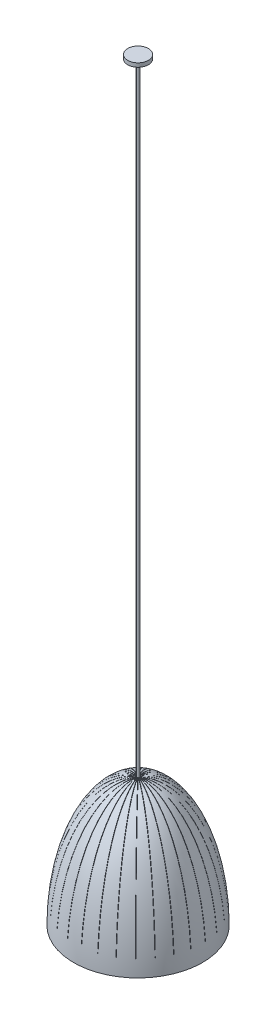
from build123d import *

# Parameters (mm, degrees)
CORTAR_EXTRUIR1_DEPTH = 2451.637672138


with BuildPart() as part:
    # Croquis1 → Revoluci_n1 (revolve)
    with BuildSketch(Plane.XY, mode=Mode.PRIVATE) as revoluci_n1_sk:
        with BuildLine():
            add(Edge.make_bspline(
                [(-4.920047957, 497.901588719), (-8.902642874, 497.742253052), (-16.832240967, 497.039688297), (-32.68000036, 494.094536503), (-52.332014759, 487.535335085), (-75.478385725, 475.108515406), (-105.459649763, 452.596403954), (-140.73165934, 413.650663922), (-177.849518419, 351.325641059), (-208.30906506, 275.76573709), (-227.163266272, 204.143466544), (-237.901740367, 143.276719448), (-243.710636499, 96.27221137), (-247.218067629, 48.374945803), (-248, 16.101194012), (-248, 0)],
                knots=[0.020001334, 0.020001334, 0.020001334, 0.020001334, 0.068463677, 0.116926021, 0.213850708, 0.310775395, 0.407700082, 0.601549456, 0.79539883, 0.989248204, 1.183097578, 1.280022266, 1.376946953, 1.47387164, 1.570796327, 1.570796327, 1.570796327, 1.570796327], degree=3))
            Line((-4.920047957, 497.901588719), (0, 497.901588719))
            Line((0, 497.901588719), (0, 500))
            Line((0, 500), (0, 2925))
            Line((0, 2925), (-40, 2925))
            Line((-40, 2925), (-40, 2910))
            Line((-40, 2910), (-10, 2910))
            Line((-10, 2910), (-10, 2900))
            Line((-10, 2900), (-5, 2900))
            Line((-5, 2900), (-5, 500))
            Line((-5, 500), (-5, 499.899989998))
            add(Edge.make_bspline(
                [(-5, 499.899989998), (-250, 490.09802941), (-250, 0)],
                knots=[0.020001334, 0.020001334, 0.020001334, 1.570796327, 1.570796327, 1.570796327], degree=2, weights=[1, 0.714142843, 1]))
            Line((-250, 0), (-248, 0))
        make_face()
    revolve(revoluci_n1_sk.sketch.rotate(Axis((0, 500, 0), (0, 1, 0)), 270), axis=Axis((0, 500, 0), (0, 1, 0)))

    # Croquis17 → Cortar-Extruir1 (cut, through all)
    with BuildSketch(Plane(origin=(0, 500, 0), x_dir=(-1, 0, 0), z_dir=(0, -1, 0))):
        with BuildLine():
            ThreePointArc((-3.425797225, 3.565925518), (-3.768789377, 3.201271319), (-4.073153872, 2.803806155))
            Line((-4.073153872, 2.803806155), (-189.339085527, 160.17010691))
            ThreePointArc((-189.339085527, 160.17010691), (-189.015793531, 160.551494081), (-188.691733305, 160.932228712))
            Line((-188.691733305, 160.932228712), (-3.425797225, 3.565925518))
        make_face()
        with BuildLine():
            ThreePointArc((-2.579135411, 4.219001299), (-2.992498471, 3.936605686), (-3.375190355, 3.613862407))
            Line((-3.375190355, 3.613862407), (-150.480604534, 197.127725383))
            ThreePointArc((-150.480604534, 197.127725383), (-150.082883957, 197.430697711), (-149.684553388, 197.732867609))
            Line((-149.684553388, 197.732867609), (-2.579135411, 4.219001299))
        make_face()
        with BuildLine():
            ThreePointArc((-1.611876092, 4.674801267), (-2.076281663, 4.487868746), (-2.519406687, 4.254938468))
            Line((-2.519406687, 4.254938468), (-104.58581772, 224.86787051))
            ThreePointArc((-104.58581772, 224.86787051), (-104.132265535, 225.078261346), (-103.678290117, 225.287737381))
            Line((-103.678290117, 225.287737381), (-1.611876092, 4.674801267))
        make_face()
        with BuildLine():
            ThreePointArc((-0.569247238, 4.912012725), (-1.062980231, 4.829284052), (-1.545818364, 4.697058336))
            Line((-1.545818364, 4.697058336), (-53.800714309, 242.093443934))
            ThreePointArc((-53.800714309, 242.093443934), (-53.31253811, 242.201415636), (-52.82414523, 242.308402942))
            Line((-52.82414523, 242.308402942), (-0.569247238, 4.912012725))
        make_face()
        with BuildLine():
            ThreePointArc((0.499998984, 4.919543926), (2.4974e-05, 4.944887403), (-0.499949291, 4.919548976))
            Line((-0.499949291, 4.919548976), (-0.499949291, 247.998996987))
            ThreePointArc((-0.499949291, 247.998996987), (2.4343e-05, 247.999500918), (0.499997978, 247.998996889))
            Line((0.499997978, 247.998996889), (0.499998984, 4.919543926))
        make_face()
        with BuildLine():
            ThreePointArc((1.545865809, 4.697042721), (1.063029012, 4.829273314), (0.569296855, 4.912006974))
            Line((0.569296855, 4.912006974), (52.8241928, 242.308392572))
            ThreePointArc((52.8241928, 242.308392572), (53.312585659, 242.20140517), (53.800761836, 242.093433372))
            Line((53.800761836, 242.093433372), (1.545865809, 4.697042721))
        make_face()
        with BuildLine():
            ThreePointArc((2.519449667, 4.254913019), (2.076326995, 4.487847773), (1.611923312, 4.674784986))
            Line((1.611923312, 4.674784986), (103.678334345, 225.287717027))
            ThreePointArc((103.678334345, 225.287717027), (104.132309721, 225.078240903), (104.585861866, 224.867849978))
            Line((104.585861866, 224.867849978), (2.519449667, 4.254913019))
        make_face()
        with BuildLine():
            ThreePointArc((3.375226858, 3.613828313), (2.992538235, 3.936575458), (2.579178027, 4.218975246))
            Line((2.579178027, 4.218975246), (149.684592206, 197.732838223))
            ThreePointArc((149.684592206, 197.732838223), (150.082922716, 197.430668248), (150.480643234, 197.127695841))
            Line((150.480643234, 197.127695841), (3.375226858, 3.613828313))
        make_face()
        with BuildLine():
            ThreePointArc((4.073182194, 2.803765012), (3.768821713, 3.20123325), (3.425833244, 3.565890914))
            Line((3.425833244, 3.565890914), (188.691764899, 160.932191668))
            ThreePointArc((188.691764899, 160.932191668), (189.01582505, 160.551456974), (189.339116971, 160.170069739))
            Line((189.339116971, 160.170069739), (4.073182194, 2.803765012))
        make_face()
        with BuildLine():
            ThreePointArc((4.580680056, 1.862600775), (4.368879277, 2.316204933), (4.112300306, 2.746069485))
            Line((4.112300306, 2.746069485), (218.87592038, 116.606534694))
            ThreePointArc((218.87592038, 116.606534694), (219.110557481, 116.165038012), (219.344304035, 115.723069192))
            Line((219.344304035, 115.723069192), (4.580680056, 1.862600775))
        make_face()
        with BuildLine():
            ThreePointArc((4.873990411, 0.834343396), (4.764652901, 1.322873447), (4.606480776, 1.7978449))
            Line((4.606480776, 1.7978449), (238.825681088, 66.828485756))
            ThreePointArc((238.825681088, 66.828485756), (238.959923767, 66.346870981), (239.093195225, 65.864986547))
            Line((239.093195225, 65.864986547), (4.873990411, 0.834343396))
        make_face()
        with BuildLine():
            ThreePointArc((4.93939839, -0.232926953), (4.937636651, 0.267685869), (4.885267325, 0.765555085))
            Line((4.885267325, 0.765555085), (247.608218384, 13.9256111))
            ThreePointArc((247.608218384, 13.9256111), (247.635789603, 13.426398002), (247.66235434, 12.927130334))
            Line((247.66235434, 12.927130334), (4.93939839, -0.232926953))
        make_face()
        with BuildLine():
            ThreePointArc((4.773845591, -1.289305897), (4.879741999, -0.800018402), (4.935624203, -0.302531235))
            Line((4.935624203, -0.302531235), (244.812870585, -39.628409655))
            ThreePointArc((244.812870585, -39.628409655), (244.732481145, -40.121878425), (244.651097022, -40.615184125))
            Line((244.651097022, -40.615184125), (4.773845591, -1.289305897))
        make_face()
        with BuildLine():
            ThreePointArc((4.385073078, -2.28539833), (4.593676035, -1.830314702), (4.755196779, -1.356471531))
            Line((4.755196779, -1.356471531), (230.570345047, -91.329450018))
            ThreePointArc((230.570345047, -91.329450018), (230.385753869, -91.794100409), (230.200226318, -92.258377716))
            Line((230.200226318, -92.258377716), (4.385073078, -2.28539833))
        make_face()
        with BuildLine():
            ThreePointArc((3.791259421, -3.174628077), (4.092814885, -2.775027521), (4.352421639, -2.346984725))
            Line((4.352421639, -2.346984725), (205.546606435, -138.760026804))
            ThreePointArc((205.546606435, -138.760026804), (205.266444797, -139.17413228), (204.985448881, -139.587672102))
            Line((204.985448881, -139.587672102), (3.791259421, -3.174628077))
        make_face()
        with BuildLine():
            ThreePointArc((3.020170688, -3.915415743), (3.40057826, -3.589983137), (3.7461321, -3.227755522))
            Line((3.7461321, -3.227755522), (170.911736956, -179.702338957))
            ThreePointArc((170.911736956, -179.702338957), (170.549104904, -180.046536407), (170.185779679, -180.390002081))
            Line((170.185779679, -180.390002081), (3.020170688, -3.915415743))
        make_face()
        with BuildLine():
            ThreePointArc((2.107862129, -4.473122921), (2.549334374, -4.237075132), (2.964677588, -3.957600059))
            Line((2.964677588, -3.957600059), (128.28522461, -212.241969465))
            ThreePointArc((128.28522461, -212.241969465), (127.857078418, -212.500164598), (127.428412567, -212.757496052))
            Line((127.428412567, -212.757496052), (2.107862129, -4.473122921))
        make_face()
        with BuildLine():
            ThreePointArc((1.096992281, -4.821671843), (1.578886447, -4.686046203), (2.044598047, -4.502391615))
            Line((2.044598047, -4.502391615), (79.660237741, -234.857401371))
            ThreePointArc((79.660237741, -234.857401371), (79.186597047, -235.01752127), (78.71263451, -235.176685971))
            Line((78.71263451, -235.176685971), (1.096992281, -4.821671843))
        make_face()
        with BuildLine():
            ThreePointArc((0.034828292, -4.944764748), (0.534611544, -4.915902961), (1.028915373, -4.836656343))
            Line((1.028915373, -4.836656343), (27.310426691, -246.491162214))
            ThreePointArc((27.310426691, -246.491162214), (26.813438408, -246.54571985), (26.316341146, -246.599275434))
            Line((26.316341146, -246.599275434), (0.034828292, -4.944764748))
        make_face()
        with BuildLine():
            ThreePointArc((-1.028964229, -4.83664595), (-0.5346612, -4.915897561), (-0.034878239, -4.944764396))
            Line((-0.034878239, -4.944764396), (-26.316389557, -246.599270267))
            ThreePointArc((-26.316389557, -246.599270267), (-26.81348681, -246.545714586), (-27.310475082, -246.491156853))
            Line((-27.310475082, -246.491156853), (-1.028964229, -4.83664595))
        make_face()
        with BuildLine():
            ThreePointArc((-2.044643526, -4.502370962), (-1.578933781, -4.686030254), (-1.097040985, -4.821660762))
            Line((-1.097040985, -4.821660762), (-78.712680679, -235.176670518))
            ThreePointArc((-78.712680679, -235.176670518), (-79.186643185, -235.017505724), (-79.660283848, -234.857385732))
            Line((-79.660283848, -234.857385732), (-2.044643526, -4.502370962))
        make_face()
        with BuildLine():
            ThreePointArc((-2.964717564, -3.957570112), (-2.549377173, -4.237049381), (-2.107907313, -4.473101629))
            Line((-2.107907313, -4.473101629), (-127.428454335, -212.757471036))
            ThreePointArc((-127.428454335, -212.757471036), (-127.857120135, -212.500139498), (-128.285266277, -212.24194428))
            Line((-128.285266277, -212.24194428), (-2.964717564, -3.957570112))
        make_face()
        with BuildLine():
            ThreePointArc((-3.746164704, -3.227717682), (-3.400614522, -3.589948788), (-3.020210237, -3.915385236))
            Line((-3.020210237, -3.915385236), (-170.185815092, -180.389968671))
            ThreePointArc((-170.185815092, -180.389968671), (-170.549140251, -180.046502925), (-170.911772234, -179.702305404))
            Line((-170.911772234, -179.702305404), (-3.746164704, -3.227717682))
        make_face()
        with BuildLine():
            ThreePointArc((-4.352445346, -2.346940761), (-4.092842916, -2.774986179), (-3.791291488, -3.174589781))
            Line((-3.791291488, -3.174589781), (-204.985476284, -139.58763186))
            ThreePointArc((-204.985476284, -139.58763186), (-205.26647212, -139.174091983), (-205.546633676, -138.759986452))
            Line((-205.546633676, -138.759986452), (-4.352445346, -2.346940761))
        make_face()
        with BuildLine():
            ThreePointArc((-4.755210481, -1.356423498), (-4.593694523, -1.830268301), (-4.385096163, -2.285354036))
            Line((-4.385096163, -2.285354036), (-230.20024443, -92.258332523))
            ThreePointArc((-230.20024443, -92.258332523), (-230.38577189, -91.794055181), (-230.570362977, -91.329404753))
            Line((-230.570362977, -91.329404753), (-4.755210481, -1.356423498))
        make_face()
        with BuildLine():
            ThreePointArc((-4.935627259, -0.30248138), (-4.87975008, -0.799969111), (-4.773858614, -1.289257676))
            Line((-4.773858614, -1.289257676), (-244.651104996, -40.615136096))
            ThreePointArc((-244.651104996, -40.615136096), (-244.732489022, -40.12183038), (-244.812878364, -39.628361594))
            Line((-244.812878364, -39.628361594), (-4.935627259, -0.30248138))
        make_face()
        with BuildLine():
            ThreePointArc((-4.885259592, 0.765604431), (-4.937633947, 0.267735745), (-4.939400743, -0.23287706))
            Line((-4.939400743, -0.23287706), (-247.662351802, 12.927178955))
            ThreePointArc((-247.662351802, 12.927178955), (-247.635786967, 13.426446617), (-247.60821565, 13.925659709))
            Line((-247.60821565, 13.925659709), (-4.885259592, 0.765604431))
        make_face()
        with BuildLine():
            ThreePointArc((-4.606462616, 1.79789143), (-4.764639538, 1.322921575), (-4.873981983, 0.834392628))
            Line((-4.873981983, 0.834392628), (-239.093182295, 65.865033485))
            ThreePointArc((-239.093182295, 65.865033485), (-238.959910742, 66.346917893), (-238.825667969, 66.828532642))
            Line((-238.825667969, 66.828532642), (-4.606462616, 1.79789143))
        make_face()
        with BuildLine():
            ThreePointArc((-4.112272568, 2.746111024), (-4.36885588, 2.316249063), (-4.580661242, 1.862647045))
            Line((-4.580661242, 1.862647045), (-219.344281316, 115.723112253))
            ThreePointArc((-219.344281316, 115.723112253), (-219.110534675, 116.165081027), (-218.875897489, 116.606577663))
            Line((-218.875897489, 116.606577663), (-4.112272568, 2.746111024))
        make_face()
    extrude(amount=CORTAR_EXTRUIR1_DEPTH, mode=Mode.SUBTRACT)


solid = part.part
